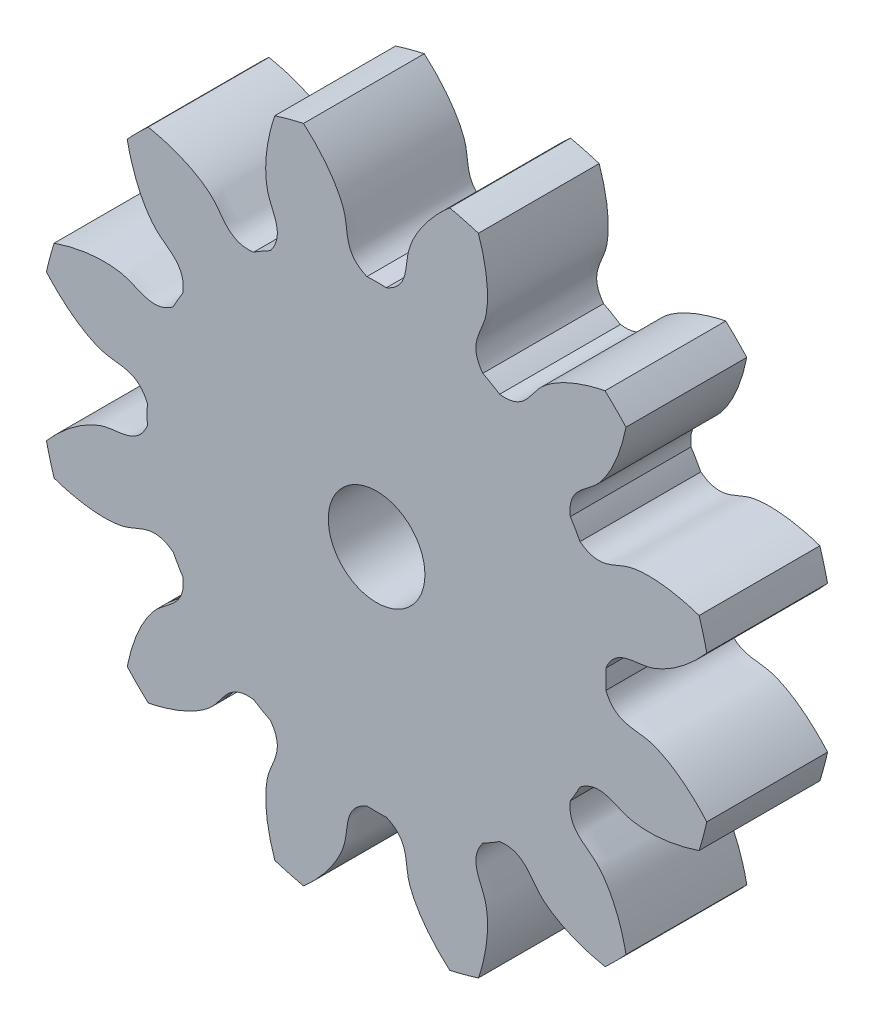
from build123d import *

# Parameters (mm, degrees)
SKETCH_1_R               = 14
EXTRUDE_1_DEPTH          = 5
CUT_EXTRUDE_1_DEPTH      = 21.420577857
PATTERN_CIRCULAR_1_COUNT = 12
SKETCH_4_R               = 2
CUT_EXTRUDE_2_DEPTH      = 10


with BuildPart() as part:
    # Sketch 1 → Extrude 1 (new body)
    with BuildSketch(Plane.XY):
        Circle(SKETCH_1_R)
    extrude(amount=EXTRUDE_1_DEPTH)

    # Sketch 2 → Cut-Extrude 1 (cut, through all)
    with BuildSketch(Plane.XY):
        with BuildLine():
            ThreePointArc((0.401680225, 9.491504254), (0, 9.5), (-0.401680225, 9.491504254))
            add(Edge.make_bspline(
                [(-0.401680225, 9.491504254), (-1.361577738, 9.898614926), (-1.148746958, 10.689637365), (-1.352304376, 11.378961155), (-1.365247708, 11.419811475), (-1.380454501, 11.46466685), (-1.398085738, 11.513452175), (-1.41830525, 11.566086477), (-1.441273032, 11.622484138), (-1.467147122, 11.682554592), (-1.496082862, 11.746202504), (-1.528232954, 11.813327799), (-1.563747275, 11.883825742), (-1.602772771, 11.957587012), (-1.645453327, 12.034497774), (-1.691929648, 12.114439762), (-1.742339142, 12.197290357), (-1.796815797, 12.282922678), (-1.855490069, 12.371205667), (-1.918488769, 12.462004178), (-1.985934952, 12.555179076), (-2.057947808, 12.650587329), (-2.134642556, 12.748082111), (-2.216130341, 12.847512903), (-2.302518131, 12.948725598), (-2.39390862, 13.051562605), (-2.490400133, 13.155862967), (-2.59208653, 13.261462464), (-2.699057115, 13.368193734), (-2.811396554, 13.475886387), (-2.929184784, 13.584367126), (-3.052496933, 13.693459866), (-3.181403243, 13.802985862), (-3.31596899, 13.912763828), (-3.456254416, 14.02261007), (-3.602314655, 14.132338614), (-3.754199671, 14.241761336), (-3.911954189, 14.350688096), (-4.07561764, 14.458926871), (-4.2452241, 14.566283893), (-4.420802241, 14.672563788), (-4.602375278, 14.77756971), (-4.789960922, 14.881103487), (-4.983571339, 14.98296576), (-5.183213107, 15.082956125), (-5.388887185, 15.18087328), (-5.600588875, 15.276515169), (-5.818307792, 15.369679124), (-6.042027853, 15.460162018), (-6.27172721, 15.547760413), (-6.588759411, 15.661455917), (-6.8311872, 15.740202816), (-6.995210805, 15.78994182)],
                knots=[0, 0, 0, 0, 0.218015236, 0.222043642, 0.226545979, 0.231522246, 0.236972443, 0.24289657, 0.249294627, 0.256166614, 0.263512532, 0.271332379, 0.279626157, 0.288393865, 0.297635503, 0.307351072, 0.31754057, 0.328203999, 0.339341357, 0.350952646, 0.363037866, 0.375597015, 0.388630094, 0.402137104, 0.416118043, 0.430572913, 0.445501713, 0.460904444, 0.476781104, 0.493131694, 0.509956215, 0.527254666, 0.545027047, 0.563273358, 0.581993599, 0.601187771, 0.620855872, 0.640997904, 0.661613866, 0.682703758, 0.704267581, 0.726305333, 0.748817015, 0.771802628, 0.795262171, 0.819195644, 0.843603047, 0.868484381, 0.893839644, 0.919668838, 0.945971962, 1, 1, 1, 1], degree=3))
            ThreePointArc((-6.995210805, 15.78994182), (0, 17.270067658), (6.995210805, 15.78994182))
            add(Edge.make_bspline(
                [(0.401680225, 9.491504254), (1.361577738, 9.898614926), (1.148746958, 10.689637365), (1.352304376, 11.378961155), (1.365247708, 11.419811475), (1.380454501, 11.46466685), (1.398085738, 11.513452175), (1.41830525, 11.566086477), (1.441273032, 11.622484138), (1.467147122, 11.682554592), (1.496082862, 11.746202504), (1.528232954, 11.813327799), (1.563747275, 11.883825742), (1.602772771, 11.957587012), (1.645453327, 12.034497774), (1.691929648, 12.114439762), (1.742339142, 12.197290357), (1.796815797, 12.282922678), (1.855490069, 12.371205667), (1.918488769, 12.462004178), (1.985934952, 12.555179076), (2.057947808, 12.650587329), (2.134642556, 12.748082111), (2.216130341, 12.847512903), (2.302518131, 12.948725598), (2.39390862, 13.051562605), (2.490400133, 13.155862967), (2.59208653, 13.261462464), (2.699057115, 13.368193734), (2.811396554, 13.475886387), (2.929184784, 13.584367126), (3.052496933, 13.693459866), (3.181403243, 13.802985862), (3.31596899, 13.912763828), (3.456254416, 14.02261007), (3.602314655, 14.132338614), (3.754199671, 14.241761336), (3.911954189, 14.350688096), (4.07561764, 14.458926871), (4.2452241, 14.566283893), (4.420802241, 14.672563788), (4.602375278, 14.77756971), (4.789960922, 14.881103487), (4.983571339, 14.98296576), (5.183213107, 15.082956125), (5.388887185, 15.18087328), (5.600588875, 15.276515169), (5.818307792, 15.369679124), (6.042027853, 15.460162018), (6.27172721, 15.547760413), (6.588759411, 15.661455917), (6.8311872, 15.740202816), (6.995210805, 15.78994182)],
                knots=[0, 0, 0, 0, 0.218015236, 0.222043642, 0.226545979, 0.231522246, 0.236972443, 0.24289657, 0.249294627, 0.256166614, 0.263512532, 0.271332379, 0.279626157, 0.288393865, 0.297635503, 0.307351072, 0.31754057, 0.328203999, 0.339341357, 0.350952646, 0.363037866, 0.375597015, 0.388630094, 0.402137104, 0.416118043, 0.430572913, 0.445501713, 0.460904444, 0.476781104, 0.493131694, 0.509956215, 0.527254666, 0.545027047, 0.563273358, 0.581993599, 0.601187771, 0.620855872, 0.640997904, 0.661613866, 0.682703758, 0.704267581, 0.726305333, 0.748817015, 0.771802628, 0.795262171, 0.819195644, 0.843603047, 0.868484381, 0.893839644, 0.919668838, 0.945971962, 1, 1, 1, 1], degree=3))
        make_face()
    cut_extrude_1 = extrude(amount=CUT_EXTRUDE_1_DEPTH, mode=Mode.SUBTRACT)

    # Pattern Circular 1: Cut-Extrude 1 ×12 about axis
    pattern_circular_1_axis = Axis((0, 0, 5), (0, 0, -1))
    for i in range(1, PATTERN_CIRCULAR_1_COUNT):
        add(cut_extrude_1.rotate(pattern_circular_1_axis, i * 360 / PATTERN_CIRCULAR_1_COUNT), mode=Mode.SUBTRACT)

    # Sketch 4 → Cut-Extrude 2 (cut)
    with BuildSketch(Plane.XY.offset(5)):
        Circle(SKETCH_4_R)
    extrude(amount=-CUT_EXTRUDE_2_DEPTH, mode=Mode.SUBTRACT)


solid = part.part
